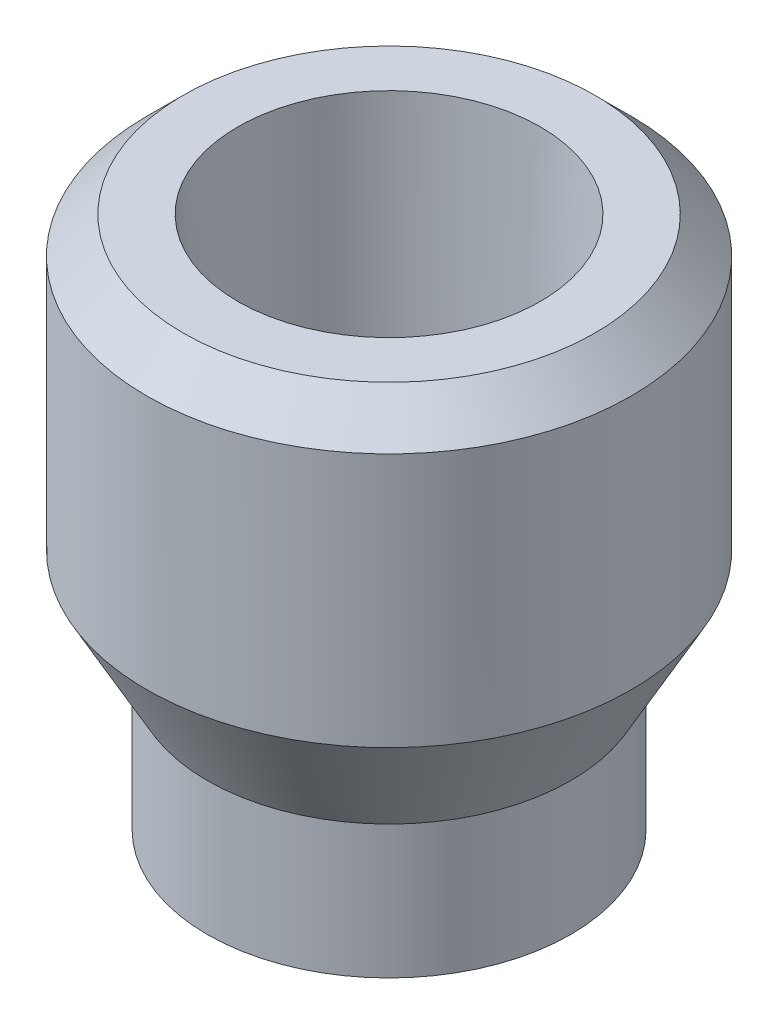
ISO-10303-21;
HEADER;
FILE_DESCRIPTION(('STEP AP214'),'2;1');
FILE_NAME('part.step','',(''),(''),'','','');
FILE_SCHEMA(('AUTOMOTIVE_DESIGN { 1 0 10303 214 1 1 1 1 }'));
ENDSEC;
DATA;
#1=APPLICATION_CONTEXT('core data for automotive mechanical design processes');
#2=APPLICATION_PROTOCOL_DEFINITION('international standard','automotive_design',2000,#1);
#3=PRODUCT_CONTEXT('',#1,'mechanical');
#4=PRODUCT('Part','Part','',(#3));
#5=PRODUCT_RELATED_PRODUCT_CATEGORY('part','',(#4));
#6=PRODUCT_DEFINITION_FORMATION('','',#4);
#7=PRODUCT_DEFINITION_CONTEXT('part definition',#1,'design');
#8=PRODUCT_DEFINITION('design','',#6,#7);
#9=PRODUCT_DEFINITION_SHAPE('','',#8);
#10=(LENGTH_UNIT() NAMED_UNIT(*) SI_UNIT(.MILLI.,.METRE.));
#11=(NAMED_UNIT(*) PLANE_ANGLE_UNIT() SI_UNIT($,.RADIAN.));
#12=(NAMED_UNIT(*) SI_UNIT($,.STERADIAN.) SOLID_ANGLE_UNIT());
#13=UNCERTAINTY_MEASURE_WITH_UNIT(LENGTH_MEASURE(1.E-05),#10,'distance_accuracy_value','');
#14=(GEOMETRIC_REPRESENTATION_CONTEXT(3) GLOBAL_UNCERTAINTY_ASSIGNED_CONTEXT((#13)) GLOBAL_UNIT_ASSIGNED_CONTEXT((#10,
#11,#12)) REPRESENTATION_CONTEXT('',''));
#15=CARTESIAN_POINT('',(0.,0.,0.));
#16=DIRECTION('',(0.,0.,1.));
#17=DIRECTION('',(1.,0.,0.));
#18=AXIS2_PLACEMENT_3D('',#15,#16,#17);
#19=CARTESIAN_POINT('',(0.,22.,0.));
#20=DIRECTION('',(0.,-1.,0.));
#21=DIRECTION('',(0.,0.,-1.));
#22=AXIS2_PLACEMENT_3D('',#19,#20,#21);
#23=CYLINDRICAL_SURFACE('',#22,10.);
#24=CARTESIAN_POINT('',(0.,20.5,0.));
#25=DIRECTION('',(0.,1.,0.));
#26=DIRECTION('',(0.,0.,1.));
#27=AXIS2_PLACEMENT_3D('',#24,#25,#26);
#28=CIRCLE('',#27,10.);
#29=CARTESIAN_POINT('',(0.,20.5,10.));
#30=VERTEX_POINT('',#29);
#31=EDGE_CURVE('E11',#30,#30,#28,.F.);
#32=ORIENTED_EDGE('',*,*,#31,.T.);
#33=EDGE_LOOP('',(#32));
#34=FACE_BOUND('',#33,.T.);
#35=CARTESIAN_POINT('',(0.,10.,0.));
#36=DIRECTION('',(0.,-1.,0.));
#37=DIRECTION('',(0.,0.,-1.));
#38=AXIS2_PLACEMENT_3D('',#35,#36,#37);
#39=CIRCLE('',#38,10.);
#40=CARTESIAN_POINT('',(0.,10.,-10.));
#41=VERTEX_POINT('',#40);
#42=EDGE_CURVE('E53',#41,#41,#39,.T.);
#43=ORIENTED_EDGE('',*,*,#42,.F.);
#44=EDGE_LOOP('',(#43));
#45=FACE_BOUND('',#44,.T.);
#46=ADVANCED_FACE('F36',(#34,#45),#23,.T.);
#47=CARTESIAN_POINT('',(0.,22.,0.));
#48=DIRECTION('',(0.,1.,0.));
#49=DIRECTION('',(0.,0.,1.));
#50=AXIS2_PLACEMENT_3D('',#47,#48,#49);
#51=PLANE('',#50);
#52=CARTESIAN_POINT('',(0.,22.,0.));
#53=DIRECTION('',(0.,1.,0.));
#54=DIRECTION('',(0.,0.,1.));
#55=AXIS2_PLACEMENT_3D('',#52,#53,#54);
#56=CIRCLE('',#55,6.2436883);
#57=CARTESIAN_POINT('',(0.,22.,6.2436883));
#58=VERTEX_POINT('',#57);
#59=EDGE_CURVE('E71',#58,#58,#56,.T.);
#60=ORIENTED_EDGE('',*,*,#59,.F.);
#61=EDGE_LOOP('',(#60));
#62=FACE_BOUND('',#61,.T.);
#63=CARTESIAN_POINT('',(0.,22.,0.));
#64=DIRECTION('',(0.,1.,0.));
#65=DIRECTION('',(0.,0.,1.));
#66=AXIS2_PLACEMENT_3D('',#63,#64,#65);
#67=CIRCLE('',#66,8.50000000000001);
#68=CARTESIAN_POINT('',(0.,22.,8.50000000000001));
#69=VERTEX_POINT('',#68);
#70=EDGE_CURVE('E44',#69,#69,#67,.T.);
#71=ORIENTED_EDGE('',*,*,#70,.T.);
#72=EDGE_LOOP('',(#71));
#73=FACE_BOUND('',#72,.T.);
#74=ADVANCED_FACE('F77',(#62,#73),#51,.T.);
#75=CARTESIAN_POINT('',(0.,10.,0.));
#76=DIRECTION('',(0.,-1.,0.));
#77=DIRECTION('',(0.,0.,-1.));
#78=AXIS2_PLACEMENT_3D('',#75,#76,#77);
#79=CYLINDRICAL_SURFACE('',#78,7.5);
#80=CARTESIAN_POINT('',(0.,5.50000000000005,0.));
#81=DIRECTION('',(0.,-1.,0.));
#82=DIRECTION('',(0.,0.,-1.));
#83=AXIS2_PLACEMENT_3D('',#80,#81,#82);
#84=CIRCLE('',#83,7.5);
#85=CARTESIAN_POINT('',(0.,5.50000000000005,-7.5));
#86=VERTEX_POINT('',#85);
#87=EDGE_CURVE('E48',#86,#86,#84,.T.);
#88=ORIENTED_EDGE('',*,*,#87,.T.);
#89=EDGE_LOOP('',(#88));
#90=FACE_BOUND('',#89,.T.);
#91=CARTESIAN_POINT('',(0.,0.,0.));
#92=DIRECTION('',(0.,-1.,0.));
#93=DIRECTION('',(0.,0.,-1.));
#94=AXIS2_PLACEMENT_3D('',#91,#92,#93);
#95=CIRCLE('',#94,7.5);
#96=CARTESIAN_POINT('',(0.,0.,-7.5));
#97=VERTEX_POINT('',#96);
#98=EDGE_CURVE('E56',#97,#97,#95,.T.);
#99=ORIENTED_EDGE('',*,*,#98,.F.);
#100=EDGE_LOOP('',(#99));
#101=FACE_BOUND('',#100,.T.);
#102=ADVANCED_FACE('F80',(#90,#101),#79,.T.);
#103=CARTESIAN_POINT('',(0.,0.,0.));
#104=DIRECTION('',(0.,1.,0.));
#105=DIRECTION('',(0.,0.,1.));
#106=AXIS2_PLACEMENT_3D('',#103,#104,#105);
#107=PLANE('',#106);
#108=CARTESIAN_POINT('',(0.,0.,0.));
#109=DIRECTION('',(0.,-1.,0.));
#110=DIRECTION('',(0.,0.,-1.));
#111=AXIS2_PLACEMENT_3D('',#108,#109,#110);
#112=CIRCLE('',#111,3.5);
#113=CARTESIAN_POINT('',(0.,0.,-3.5));
#114=VERTEX_POINT('',#113);
#115=EDGE_CURVE('E59',#114,#114,#112,.T.);
#116=ORIENTED_EDGE('',*,*,#115,.F.);
#117=EDGE_LOOP('',(#116));
#118=FACE_BOUND('',#117,.T.);
#119=ORIENTED_EDGE('',*,*,#98,.T.);
#120=EDGE_LOOP('',(#119));
#121=FACE_BOUND('',#120,.T.);
#122=ADVANCED_FACE('F95',(#118,#121),#107,.F.);
#123=CARTESIAN_POINT('',(0.,5.50000000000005,0.));
#124=DIRECTION('',(0.,1.,0.));
#125=DIRECTION('',(0.,0.,1.));
#126=AXIS2_PLACEMENT_3D('',#123,#124,#125);
#127=CONICAL_SURFACE('',#126,7.5,0.507098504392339);
#128=ORIENTED_EDGE('',*,*,#42,.T.);
#129=EDGE_LOOP('',(#128));
#130=FACE_BOUND('',#129,.T.);
#131=ORIENTED_EDGE('',*,*,#87,.F.);
#132=EDGE_LOOP('',(#131));
#133=FACE_BOUND('',#132,.T.);
#134=ADVANCED_FACE('F86',(#130,#133),#127,.T.);
#135=CARTESIAN_POINT('',(0.,22.,0.));
#136=DIRECTION('',(0.,-1.,0.));
#137=DIRECTION('',(0.,0.,-1.));
#138=AXIS2_PLACEMENT_3D('',#135,#136,#137);
#139=CONICAL_SURFACE('',#138,8.50000000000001,0.785398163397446);
#140=ORIENTED_EDGE('',*,*,#31,.F.);
#141=EDGE_LOOP('',(#140));
#142=FACE_BOUND('',#141,.T.);
#143=ORIENTED_EDGE('',*,*,#70,.F.);
#144=EDGE_LOOP('',(#143));
#145=FACE_BOUND('',#144,.T.);
#146=ADVANCED_FACE('F38',(#142,#145),#139,.T.);
#147=CARTESIAN_POINT('',(0.,22.,0.));
#148=DIRECTION('',(0.,-1.,0.));
#149=DIRECTION('',(0.,0.,-1.));
#150=AXIS2_PLACEMENT_3D('',#147,#148,#149);
#151=CYLINDRICAL_SURFACE('',#150,3.5);
#152=CARTESIAN_POINT('',(0.,6.80915733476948,0.));
#153=DIRECTION('',(0.,1.,0.));
#154=DIRECTION('',(0.,0.,1.));
#155=AXIS2_PLACEMENT_3D('',#152,#153,#154);
#156=CIRCLE('',#155,3.5);
#157=CARTESIAN_POINT('',(0.,6.80915733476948,3.5));
#158=VERTEX_POINT('',#157);
#159=EDGE_CURVE('E40',#158,#158,#156,.T.);
#160=ORIENTED_EDGE('',*,*,#159,.T.);
#161=EDGE_LOOP('',(#160));
#162=FACE_BOUND('',#161,.T.);
#163=ORIENTED_EDGE('',*,*,#115,.T.);
#164=EDGE_LOOP('',(#163));
#165=FACE_BOUND('',#164,.T.);
#166=ADVANCED_FACE('F85',(#162,#165),#151,.F.);
#167=CARTESIAN_POINT('',(0.,8.,0.));
#168=DIRECTION('',(0.,1.,0.));
#169=DIRECTION('',(0.,0.,1.));
#170=AXIS2_PLACEMENT_3D('',#167,#168,#169);
#171=CONICAL_SURFACE('',#170,5.5626,1.0471975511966);
#172=CARTESIAN_POINT('',(0.,8.,0.));
#173=DIRECTION('',(0.,1.,0.));
#174=DIRECTION('',(0.,0.,1.));
#175=AXIS2_PLACEMENT_3D('',#172,#173,#174);
#176=CIRCLE('',#175,5.5626);
#177=CARTESIAN_POINT('',(0.,8.,5.5626));
#178=VERTEX_POINT('',#177);
#179=EDGE_CURVE('E62',#178,#178,#176,.T.);
#180=ORIENTED_EDGE('',*,*,#179,.T.);
#181=EDGE_LOOP('',(#180));
#182=FACE_BOUND('',#181,.T.);
#183=ORIENTED_EDGE('',*,*,#159,.F.);
#184=EDGE_LOOP('',(#183));
#185=FACE_BOUND('',#184,.T.);
#186=ADVANCED_FACE('F92',(#182,#185),#171,.F.);
#187=CARTESIAN_POINT('',(0.,22.,0.));
#188=DIRECTION('',(0.,1.,0.));
#189=DIRECTION('',(0.,0.,1.));
#190=AXIS2_PLACEMENT_3D('',#187,#188,#189);
#191=CYLINDRICAL_SURFACE('',#190,5.5626);
#192=ORIENTED_EDGE('',*,*,#179,.F.);
#193=EDGE_LOOP('',(#192));
#194=FACE_BOUND('',#193,.T.);
#195=CARTESIAN_POINT('',(0.,11.98,0.));
#196=DIRECTION('',(0.,1.,0.));
#197=DIRECTION('',(0.,0.,1.));
#198=AXIS2_PLACEMENT_3D('',#195,#196,#197);
#199=CIRCLE('',#198,5.5626);
#200=CARTESIAN_POINT('',(0.,11.98,5.5626));
#201=VERTEX_POINT('',#200);
#202=EDGE_CURVE('E65',#201,#201,#199,.T.);
#203=ORIENTED_EDGE('',*,*,#202,.T.);
#204=EDGE_LOOP('',(#203));
#205=FACE_BOUND('',#204,.T.);
#206=ADVANCED_FACE('F111',(#194,#205),#191,.F.);
#207=CARTESIAN_POINT('',(5.5626,11.98,0.));
#208=DIRECTION('',(0.,-1.,0.));
#209=DIRECTION('',(0.,0.,-1.));
#210=AXIS2_PLACEMENT_3D('',#207,#208,#209);
#211=PLANE('',#210);
#212=ORIENTED_EDGE('',*,*,#202,.F.);
#213=EDGE_LOOP('',(#212));
#214=FACE_BOUND('',#213,.T.);
#215=CARTESIAN_POINT('',(0.,11.98,0.));
#216=DIRECTION('',(0.,1.,0.));
#217=DIRECTION('',(0.,0.,1.));
#218=AXIS2_PLACEMENT_3D('',#215,#216,#217);
#219=CIRCLE('',#218,5.94367608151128);
#220=CARTESIAN_POINT('',(0.,11.98,5.94367608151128));
#221=VERTEX_POINT('',#220);
#222=EDGE_CURVE('E68',#221,#221,#219,.T.);
#223=ORIENTED_EDGE('',*,*,#222,.T.);
#224=EDGE_LOOP('',(#223));
#225=FACE_BOUND('',#224,.T.);
#226=ADVANCED_FACE('F115',(#214,#225),#211,.F.);
#227=CARTESIAN_POINT('',(0.,22.,0.));
#228=DIRECTION('',(0.,1.,0.));
#229=DIRECTION('',(0.,0.,1.));
#230=AXIS2_PLACEMENT_3D('',#227,#228,#229);
#231=CONICAL_SURFACE('',#230,6.2436883,0.0299323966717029);
#232=ORIENTED_EDGE('',*,*,#222,.F.);
#233=EDGE_LOOP('',(#232));
#234=FACE_BOUND('',#233,.T.);
#235=ORIENTED_EDGE('',*,*,#59,.T.);
#236=EDGE_LOOP('',(#235));
#237=FACE_BOUND('',#236,.T.);
#238=ADVANCED_FACE('F75',(#234,#237),#231,.F.);
#239=CLOSED_SHELL('',(#46,#74,#102,#122,#134,#146,#166,#186,#206,#226,#238));
#240=MANIFOLD_SOLID_BREP('B2',#239);
#241=ADVANCED_BREP_SHAPE_REPRESENTATION('',(#18,#240),#14);
#242=SHAPE_DEFINITION_REPRESENTATION(#9,#241);
ENDSEC;
END-ISO-10303-21;
